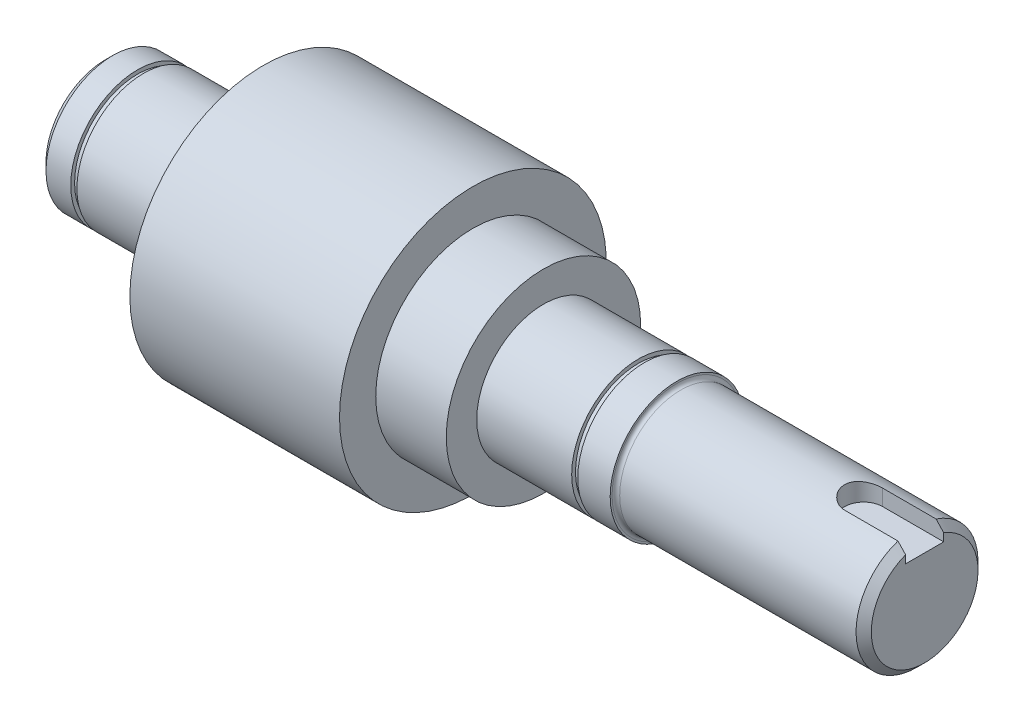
from build123d import *

# Parameters (mm, degrees)
CHANFREIN1_SIZE         = 2
ENL_V_MAT_EXTRU_3_DEPTH = 5


with BuildPart() as part:
    # Esquisse1 → Base-R_volution (revolve)
    with BuildSketch(Plane.XY, mode=Mode.PRIVATE) as base_r_volution_sk:
        with BuildLine():
            Line((-27.5, 35), (27.5, 35))
            Line((27.5, 35), (27.5, 25.5))
            Line((27.5, 25.5), (46, 25.5))
            Line((46, 25.5), (46, 17.5))
            Line((46, 17.5), (70.9, 17.5))
            Line((70.9, 17.5), (70.9, 16.5))
            Line((70.9, 16.5), (72.5, 16.5))
            Line((72.5, 16.5), (72.5, 17.5))
            Line((72.5, 17.5), (81, 17.5))
            Line((81, 17.5), (81, 17))
            ThreePointArc((81, 17), (81.292893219, 16.292893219), (82, 16))
            Line((82, 16), (146, 16))
            Line((146, 16), (146, 0))
            Line((146, 0), (-69, 0))
            Line((-69, 0), (-69, 17.5))
            Line((-69, 17.5), (-60.5, 17.5))
            Line((-60.5, 17.5), (-60.5, 16.5))
            Line((-60.5, 16.5), (-58.9, 16.5))
            Line((-58.9, 16.5), (-58.9, 17.5))
            Line((-58.9, 17.5), (-34, 17.5))
            Line((-34, 17.5), (-34, 25.5))
            Line((-34, 25.5), (-27.5, 25.5))
            Line((-27.5, 25.5), (-27.5, 35))
        make_face()
    revolve(base_r_volution_sk.sketch.rotate(Axis((-77.987654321, 0, 0), (1, 0, 0)), 90), axis=Axis((-77.987654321, 0, 0), (1, 0, 0)))

    # Chanfrein1
    chanfrein1_edges = [part.edges().sort_by_distance(p)[0] for p in [
        (-69, 0, -17.5),
        (146, 0, -16),
    ]]
    chamfer(chanfrein1_edges, length=CHANFREIN1_SIZE)

    # Esquisse4 → Enl_v. mat.-Extru.3 (cut)
    with BuildSketch(Plane(origin=(0, 16, 0), x_dir=(-1, 0, 0), z_dir=(0, 1, 0))):
        with BuildLine():
            Line((-130, -5), (-146, -5))
            Line((-146, -5), (-146, 5))
            Line((-146, 5), (-130, 5))
            ThreePointArc((-130, 5), (-125, 0), (-130, -5))
        make_face()
    extrude(amount=-ENL_V_MAT_EXTRU_3_DEPTH, mode=Mode.SUBTRACT)


solid = part.part
